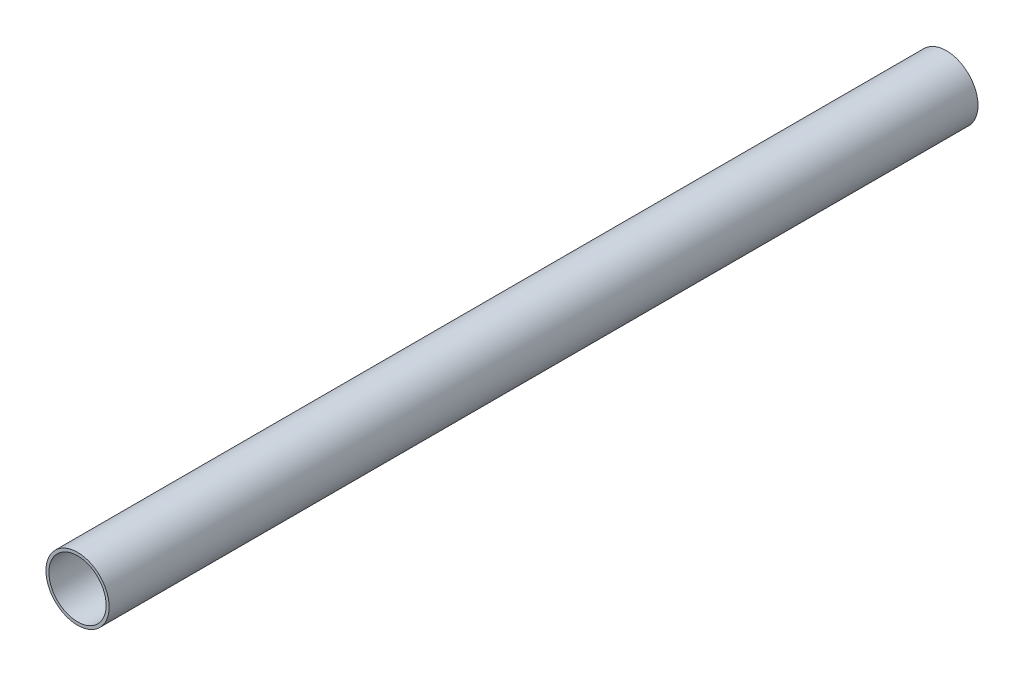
from build123d import *

# Parameters (mm, degrees)
SKETCH1_R          = 8
EXTRUDE1_DEPTH     = 220
SKETCH2_R          = 7.25
CUT_EXTRUDE1_DEPTH = 221.290717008


with BuildPart() as part:
    # Sketch1 → Extrude1 (new body)
    with BuildSketch(Plane.XY):
        Circle(SKETCH1_R)
    extrude(amount=-EXTRUDE1_DEPTH)

    # Sketch2 → Cut-Extrude1 (cut, through all)
    with BuildSketch(Plane.XY):
        Circle(SKETCH2_R)
    extrude(amount=-CUT_EXTRUDE1_DEPTH, mode=Mode.SUBTRACT)


solid = part.part
